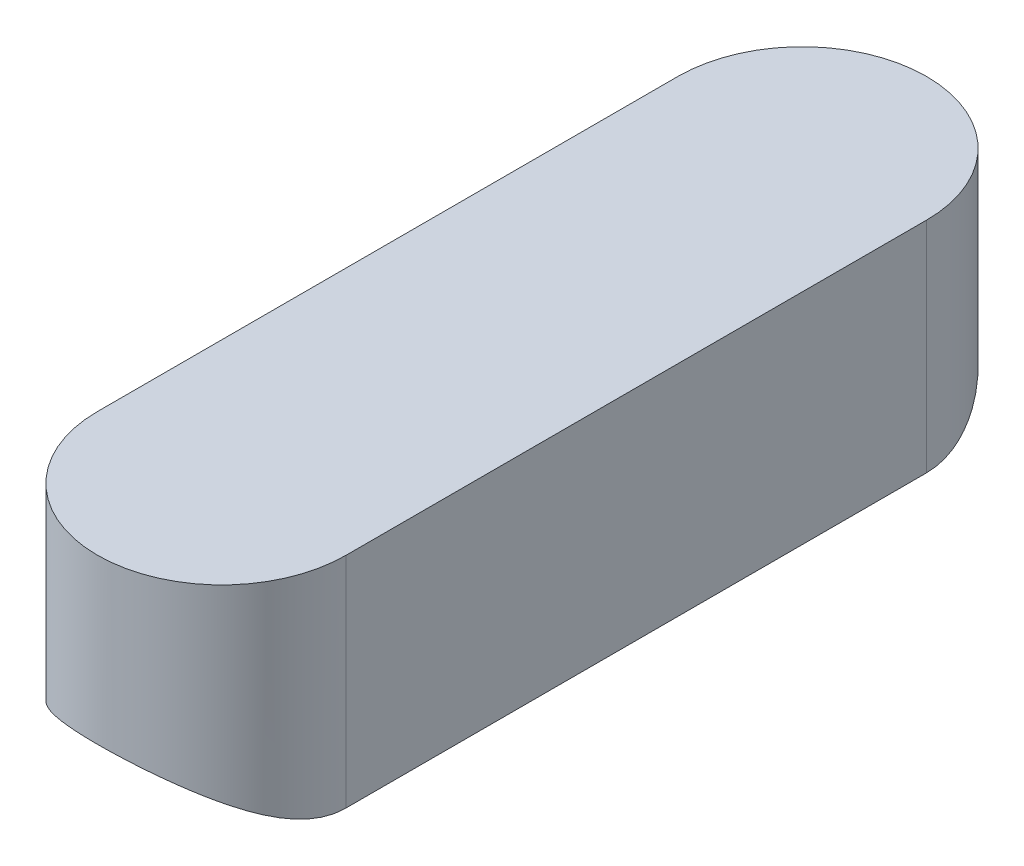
from build123d import *

# Parameters (mm, degrees)
BOSS_EXTRUDE1_DEPTH = 20
SKETCH2_OUTSIDE_W   = 12.308
SKETCH2_OUTSIDE_H   = 26.308
CUT_EXTRUDE2_DEPTH  = 21.901445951


with BuildPart() as part:
    # Sketch1 → Boss-Extrude1 (new body)
    with BuildSketch(Plane.XY):
        with BuildLine():
            Line((3, 2.720753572), (3, 8))
            Line((3, 8), (-3, 8))
            Line((-3, 8), (-3, 2.720753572))
            ThreePointArc((-3, 2.720753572), (0, 4.05), (3, 2.720753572))
        make_face()
    extrude(amount=BOSS_EXTRUDE1_DEPTH)

    # Sketch2 outside → Cut-Extrude2 (cut, through all)
    with BuildSketch(Plane(origin=(0, 8, 0), x_dir=(1, 0, 0), z_dir=(0, 1, 0))):
        with Locations((0, -10)):
            Rectangle(SKETCH2_OUTSIDE_W, SKETCH2_OUTSIDE_H)
        with BuildLine():
            Line((-3, -3), (-3, -17))
            ThreePointArc((-3, -17), (0, -20), (3, -17))
            Line((3, -17), (3, -3))
            ThreePointArc((3, -3), (0, 0), (-3, -3))
        make_face(mode=Mode.SUBTRACT)
    extrude(amount=-CUT_EXTRUDE2_DEPTH, mode=Mode.SUBTRACT)


solid = part.part
